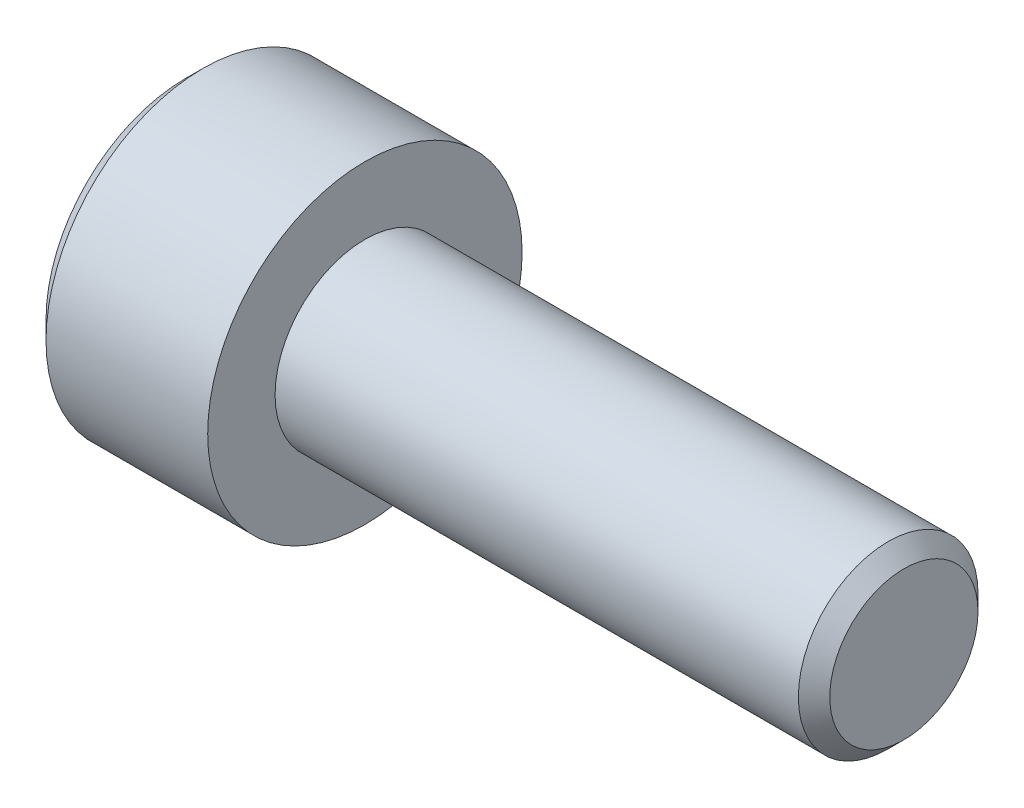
from build123d import *

# Parameters (mm, degrees)
SKETCH1_R           = 3.5
BOSS_EXTRUDE1_DEPTH = 4
CUT_EXTRUDE1_DEPTH  = 2.2
CHAMFER1_SIZE       = 0.4
SKETCH4_R           = 2
BOSS_EXTRUDE2_DEPTH = 12
CHAMFER2_SIZE       = 0.35


with BuildPart() as part:
    # Sketch1 → Boss-Extrude1 (new body)
    with BuildSketch(Plane(origin=(0, 0, 0), x_dir=(0, 0, -1), z_dir=(1, 0, 0))):
        Circle(SKETCH1_R)
    extrude(amount=BOSS_EXTRUDE1_DEPTH)

    # Sketch2 → Cut-Extrude1 (cut)
    with BuildSketch(Plane.ZY):
        Polygon((-1.732050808, 0), (-0.866025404, -1.5), (0.866025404, -1.5), (1.732050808, 0), (0.866025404, 1.5), (-0.866025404, 1.5), align=None)
    extrude(amount=-CUT_EXTRUDE1_DEPTH, mode=Mode.SUBTRACT)

    # Chamfer1
    chamfer1_edges = [part.edges().sort_by_distance(p)[0] for p in [
        (0, 0, 3.5),
    ]]
    chamfer(chamfer1_edges, length=CHAMFER1_SIZE)

    # Sketch4 → Boss-Extrude2 (add)
    with BuildSketch(Plane(origin=(4, 0, 0), x_dir=(0, 0, -1), z_dir=(1, 0, 0))):
        Circle(SKETCH4_R)
    extrude(amount=BOSS_EXTRUDE2_DEPTH)

    # Chamfer2
    chamfer2_edges = [part.edges().sort_by_distance(p)[0] for p in [
        (16, 0, 2),
    ]]
    chamfer(chamfer2_edges, length=CHAMFER2_SIZE)


solid = part.part
